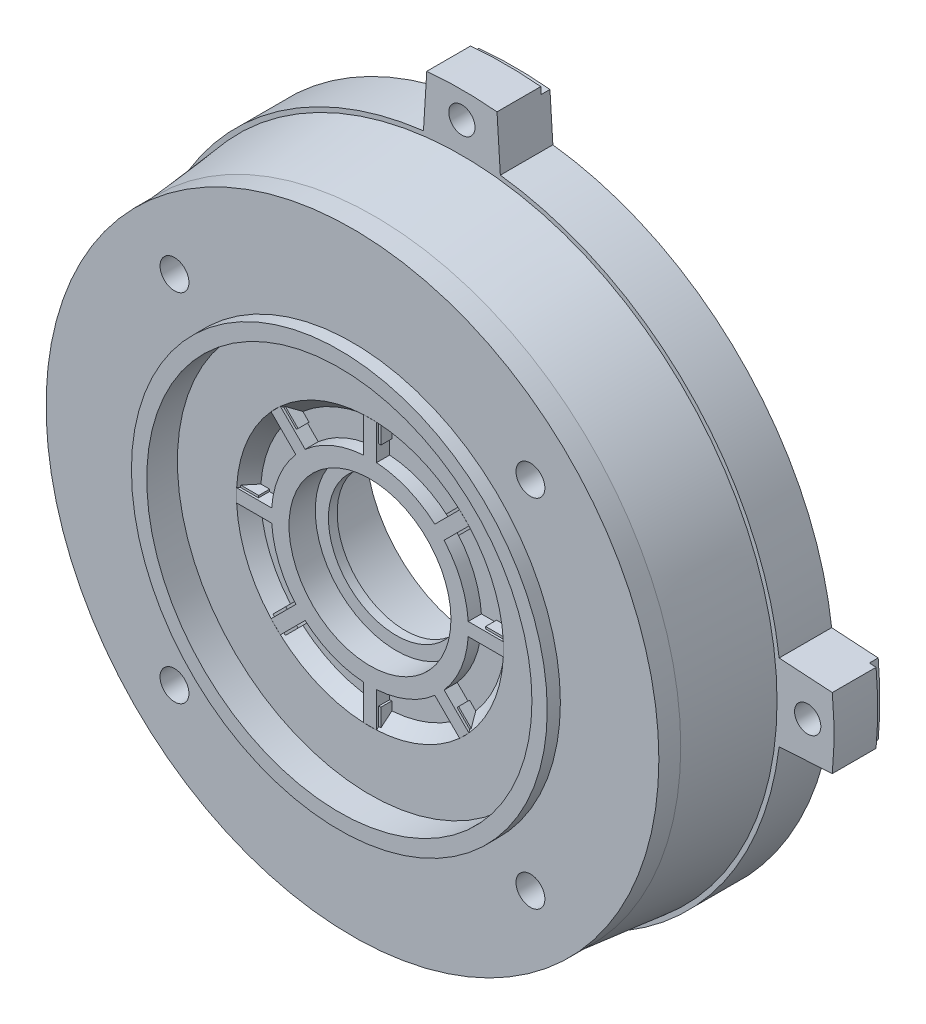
from build123d import *

# Parameters (mm, degrees)
CUT_EXTRUDE_START         = -4
SKETCH_2_R                = 70
CUT_EXTRUDE_1_DEPTH       = 4
SKETCH_3_W                = 3
SKETCH_3_H                = 8.956822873
EXTRUDE_1_DEPTH           = 3
PATTERN_CIRCULAR_1_COUNT  = 8
EXTRUDE_START             = -12
EXTRUDE_2_DEPTH           = 12
PATTERN_CIRCULAR_2_COUNT  = 4
SKETCH_5_OUTSIDE_W        = 220.744
SKETCH_5_OUTSIDE_H        = 220.744
SKETCH_5_OUTSIDE_R        = 83.5
CUT_EXTRUDE_2_DEPTH       = 2
SKETCH_7_R                = 3
CUT_EXTRUDE_4_DEPTH       = 127.688594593
PATTERN_CIRCULAR_4_COUNT  = 4
EXTRUDE_START_2           = 7.5
EXTRUDE_5_DEPTH           = 7.5
PATTERN_CIRCULAR_7_COUNT  = 8
SKETCH_15_R               = 3.3
CUT_EXTRUDE_7_DEPTH       = 123.780291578
PATTERN_CIRCULAR_8_COUNT  = 4
EXTRUDE_6_REACH           = 126.395
PATTERN_CIRCULAR_9_COUNT  = 6
PATTERN_CIRCULAR_10_COUNT = 3


with BuildPart() as part:
    # Sketch 1 → Revolve 1 (revolve)
    with BuildSketch(Plane(origin=(0, 0, 0), x_dir=(1, 0, 0), z_dir=(0, 1, 0))):
        with BuildLine():
            Line((15.5, 4.186670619), (22.5, 4.186670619))
            Line((22.5, 4.186670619), (22.5, 5.186670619))
            Line((22.5, 5.186670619), (26, 5.186670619))
            Line((26, 5.186670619), (26, 21.186670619))
            Line((26, 21.186670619), (34, 21.186670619))
            Line((34, 21.186670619), (34, 0.186670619))
            Line((34, 0.186670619), (46, 0.186670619))
            Line((46, 0.186670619), (48, -3.313329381))
            Line((48, -3.313329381), (66.432543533, -3.313329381))
            Line((66.432543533, -3.313329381), (68.702231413, 19.383549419))
            ThreePointArc((68.702231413, 19.383549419), (68.925511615, 22.364950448), (69, 25.353772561))
            Line((69, 25.353772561), (69, 29.186670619))
            Line((69, 29.186670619), (73, 29.186670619))
            Line((73, 29.186670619), (73, 17.186670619))
            Line((73, 17.186670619), (72, 17.186670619))
            Line((72, 17.186670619), (70, -2.813329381))
            Line((70, -2.813329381), (70, -7.813329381))
            Line((70, -7.813329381), (47.5, -7.813329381))
            Line((47.5, -7.813329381), (47.5, -10.813329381))
            Line((47.5, -10.813329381), (44, -10.813329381))
            Line((44, -10.813329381), (44, -3.813329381))
            Line((44, -3.813329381), (30.5, -3.813329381))
            Line((30.5, -3.813329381), (28, -0.813329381))
            Line((28, -0.813329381), (22.5, -0.813329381))
            Line((22.5, -0.813329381), (22.5, -3.813329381))
            Line((22.5, -3.813329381), (18.5, -3.813329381))
            Line((18.5, -3.813329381), (18.5, 2.186670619))
            Line((18.5, 2.186670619), (15.5, 2.186670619))
            Line((15.5, 2.186670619), (15.5, 4.186670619))
        make_face()
    revolve(axis=Axis((0, 0, 0), (0, 0, -1)))

    # Sketch 2 → Cut-Extrude 1 (cut)
    with BuildSketch(Plane(origin=(0, 0, -29.186670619), x_dir=(-1, 0, 0), z_dir=(0, 0, -1)).offset(CUT_EXTRUDE_START)):
        with Locations(Location((0, 0, 0), (0, 0, 180))):
            Circle(SKETCH_2_R)
    extrude(amount=CUT_EXTRUDE_1_DEPTH, mode=Mode.SUBTRACT)

    # Sketch 3 → Extrude 1 (add)
    with BuildSketch(Plane.XY.offset(3.813329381)):
        with Locations((0, 25.984680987)):
            Rectangle(SKETCH_3_W, SKETCH_3_H)
    extrude_1 = extrude(amount=-EXTRUDE_1_DEPTH)

    # Pattern Circular 1: Extrude 1 ×8 about axis
    pattern_circular_1_axis = Axis((0, 0, 0), (0, 0, 1))
    for i in range(1, PATTERN_CIRCULAR_1_COUNT):
        add(extrude_1.rotate(pattern_circular_1_axis, i * 360 / PATTERN_CIRCULAR_1_COUNT))

    # Sketch 4 → Extrude 2 (add)
    with BuildSketch(Plane(origin=(0, 0, -29.186670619), x_dir=(-1, 0, 0), z_dir=(0, 0, -1)).offset(EXTRUDE_START)):
        with BuildLine():
            Line((8.023722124, 84.620446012), (8.973597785, 69.422435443))
            ThreePointArc((8.973597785, 69.422435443), (0, 70), (-8.973597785, 69.422435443))
            Line((-8.973597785, 69.422435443), (-8.023722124, 84.620446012))
            ThreePointArc((-8.023722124, 84.620446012), (0, 85), (8.023722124, 84.620446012))
        make_face()
    extrude_2 = extrude(amount=EXTRUDE_2_DEPTH)

    # Pattern Circular 2: Extrude 2 ×4 about axis
    pattern_circular_2_axis = Axis((0, 0, 0), (0, 0, 1))
    for i in range(1, PATTERN_CIRCULAR_2_COUNT):
        add(extrude_2.rotate(pattern_circular_2_axis, i * 360 / PATTERN_CIRCULAR_2_COUNT))

    # Sketch 5 outside → Cut-Extrude 2 (cut)
    with BuildSketch(Plane(origin=(0, 0, -29.186670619), x_dir=(-1, 0, 0), z_dir=(0, 0, -1))):
        Rectangle(SKETCH_5_OUTSIDE_W, SKETCH_5_OUTSIDE_H)
        Circle(SKETCH_5_OUTSIDE_R, mode=Mode.SUBTRACT)
    extrude(amount=-CUT_EXTRUDE_2_DEPTH, mode=Mode.SUBTRACT)

    # Sketch 7 → Cut-Extrude 4 (cut, through all)
    with BuildSketch(Plane(origin=(0, 0, -29.186670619), x_dir=(-1, 0, 0), z_dir=(0, 0, -1))):
        with Locations((0, 79)):
            Circle(SKETCH_7_R)
    cut_extrude_4 = extrude(amount=-CUT_EXTRUDE_4_DEPTH, mode=Mode.SUBTRACT)

    # Pattern Circular 4: Cut-Extrude 4 ×4 about axis
    pattern_circular_4_axis = Axis((0, 0, 0), (0, 0, 1))
    for i in range(1, PATTERN_CIRCULAR_4_COUNT):
        add(cut_extrude_4.rotate(pattern_circular_4_axis, i * 360 / PATTERN_CIRCULAR_4_COUNT), mode=Mode.SUBTRACT)

    # Sketch 14 → Extrude 5 (add)
    with BuildSketch(Plane(origin=(0, 0, 3.313329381), x_dir=(-1, 0, 0), z_dir=(0, 0, -1)).offset(EXTRUDE_START_2)):
        with BuildLine():
            Line((46.03708294, 35.431561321), (51.902053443, 41.466368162))
            ThreePointArc((51.902053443, 41.466368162), (46.974902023, 46.974902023), (41.466368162, 51.902053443))
            Line((41.466368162, 51.902053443), (35.431561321, 46.03708294))
            ThreePointArc((35.431561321, 46.03708294), (33.234236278, 41.720821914), (34.133164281, 36.961591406))
            Line((34.133164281, 36.961591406), (16.916089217, 19.744516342))
            ThreePointArc((16.916089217, 19.744516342), (18.384776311, 18.384776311), (19.744516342, 16.916089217))
            Line((19.744516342, 16.916089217), (36.961591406, 34.133164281))
            ThreePointArc((36.961591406, 34.133164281), (41.720821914, 33.234236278), (46.03708294, 35.431561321))
        make_face()
    extrude_5 = extrude(amount=-EXTRUDE_5_DEPTH)

    # Pattern Circular 7: Extrude 5 ×8 about axis
    pattern_circular_7_axis = Axis((0, 0, 0), (0, 0, 1))
    for i in range(1, PATTERN_CIRCULAR_7_COUNT):
        add(extrude_5.rotate(pattern_circular_7_axis, i * 360 / PATTERN_CIRCULAR_7_COUNT))

    # Sketch 15 → Cut-Extrude 7 (cut, through all)
    with BuildSketch(Plane(origin=(0, 0, -4.186670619), x_dir=(-1, 0, 0), z_dir=(0, 0, -1))):
        with Locations((40.658639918, 40.658639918)):
            Circle(SKETCH_15_R)
    cut_extrude_7 = extrude(amount=-CUT_EXTRUDE_7_DEPTH, mode=Mode.SUBTRACT)

    # Pattern Circular 8: Cut-Extrude 7 ×4 about axis
    pattern_circular_8_axis = Axis((0, 0, 0), (0, 0, 1))
    for i in range(1, PATTERN_CIRCULAR_8_COUNT):
        add(cut_extrude_7.rotate(pattern_circular_8_axis, i * 360 / PATTERN_CIRCULAR_8_COUNT), mode=Mode.SUBTRACT)

    # Extrude 6: up to this face of the body (flat: up to its plane)
    extrude_6_end = Plane(part.part.faces().sort_by_distance((15.137734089, 36.545722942, -0.186670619))[0])
    # Sketch 16 → Extrude 6 (add, up to the picked face)
    with BuildSketch(Plane(origin=(0, 0, -21.186670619), x_dir=(-1, 0, 0), z_dir=(0, 0, -1)), mode=Mode.PRIVATE) as extrude_6_sk1:
        with BuildLine():
            ThreePointArc((3.792758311, 27.741935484), (0, 36), (-3.792758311, 27.741935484))
            ThreePointArc((-3.792758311, 27.741935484), (0, 28), (3.792758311, 27.741935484))
        make_face()
    extrude_6_tool1 = split(extrude(extrude_6_sk1.sketch, amount=-EXTRUDE_6_REACH, mode=Mode.PRIVATE), bisect_by=extrude_6_end, keep=Keep.BOTH, mode=Mode.PRIVATE)
    extrude_6 = extrude_6_tool1.solids().sort_by(Axis((0, 31.594938, -21.186671), (0, 0, 1)))[0]
    add(extrude_6)

    # Pattern Circular 9: Extrude 6 ×6 about axis
    pattern_circular_9_axis = Axis((0, 0, 0), (0, 0, 1))
    for i in range(1, PATTERN_CIRCULAR_9_COUNT):
        add(extrude_6.rotate(pattern_circular_9_axis, i * 360 / PATTERN_CIRCULAR_9_COUNT))

    # Cut-Extrude 8 cone 1 section (on through the dimple's axis) → Cut-Extrude 8 (revolve, cut)
    with BuildSketch(Plane(origin=(0, 31, -21.186670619), x_dir=(0, 1, 0), z_dir=(1, 0, 0))):
        Polygon((0, 0), (2.05, 0), (0, 2.05), align=None)
    cut_extrude_8 = revolve(axis=Axis((0, 31, -21.186670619), (0, 0, 1)), mode=Mode.SUBTRACT)

    # Pattern Circular 10: Cut-Extrude 8 ×3 about axis
    pattern_circular_10_axis = Axis((0, 0, 0), (0, 0, 1))
    for i in range(1, PATTERN_CIRCULAR_10_COUNT):
        add(cut_extrude_8.rotate(pattern_circular_10_axis, i * 360 / PATTERN_CIRCULAR_10_COUNT), mode=Mode.SUBTRACT)


solid = part.part
